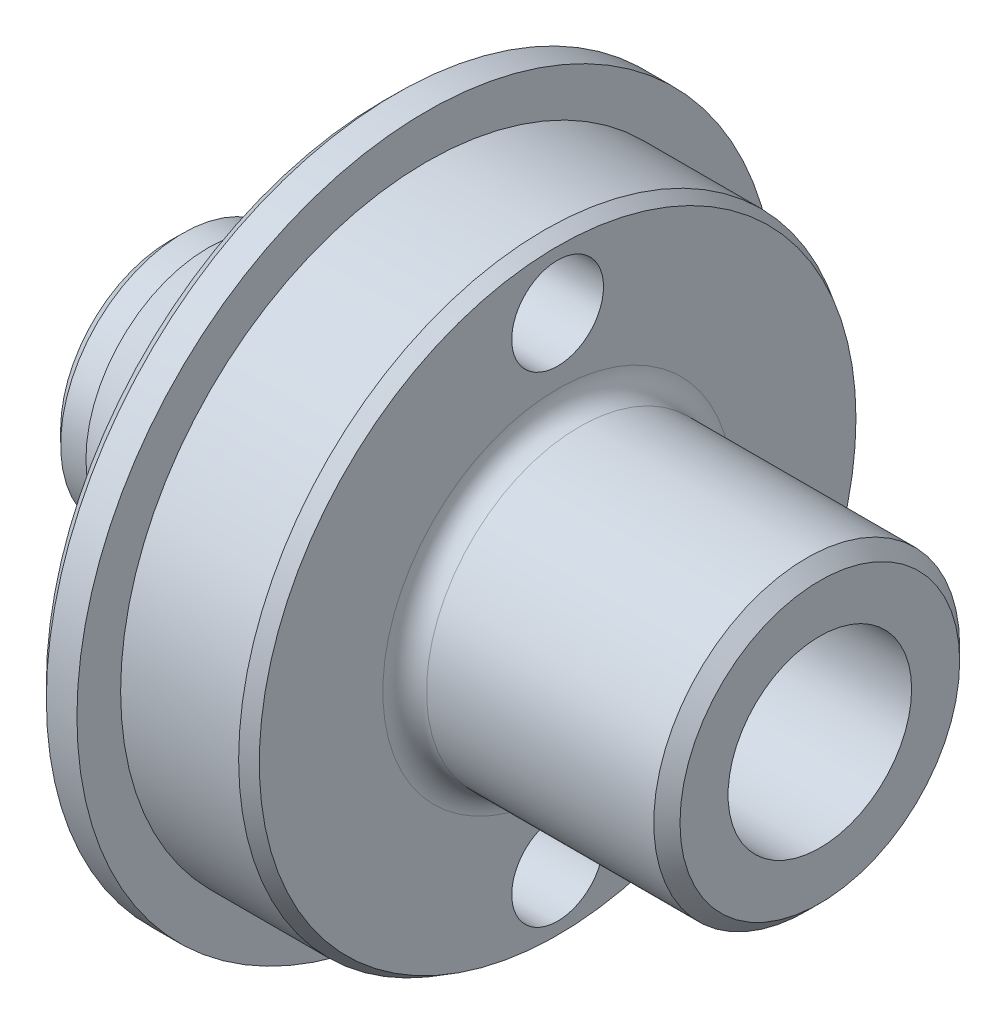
from build123d import *

# Parameters (mm, degrees)
ESQUISSE1_W           = 1
ESQUISSE1_H           = 8
ESQUISSE2_R           = 7
BOSS_EXTRU_1_DEPTH    = 3
ESQUISSE3_R           = 3.5
BOSS_EXTRU_2_DEPTH    = 6
ESQUISSE4_R           = 4.25
BOSS_EXTRU_3_DEPTH    = 4
BOSS_EXTRU_3_TAPER    = 20
ESQUISSE5_R           = 2.794119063
BOSS_EXTRU_4_DEPTH    = 0.878783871
PER_AGE1_D            = 2.1
PER_AGE2_D            = 2.1
TROU_TARAUD_M51_D     = 4.2
TROU_TARAUD_M51_DEPTH = 7.5
TROU_TARAUD_M51_TIP   = 1.2618073
CHANFREIN1_SIZE       = 0.3
CHANFREIN1_SIZE2      = 0.173205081
CONG_1_R              = 0.5
CHANFREIN3_SIZE       = 0.3
CHANFREIN4_SIZE       = 0.3


with BuildPart() as part:
    # Esquisse1 → R_volution1 (revolve)
    with BuildSketch(Plane.XY, mode=Mode.PRIVATE) as r_volution1_sk:
        with Locations((5.5, 4)):
            Rectangle(ESQUISSE1_W, ESQUISSE1_H)
    revolve(r_volution1_sk.sketch.rotate(Axis((5, 0, 0), (1, 0, 0)), 270), axis=Axis((5, 0, 0), (1, 0, 0)))

    # Esquisse2 → Boss.-Extru.1 (add)
    with BuildSketch(Plane(origin=(6, 0, 0), x_dir=(0, 0, -1), z_dir=(1, 0, 0))):
        Circle(ESQUISSE2_R)
    extrude(amount=BOSS_EXTRU_1_DEPTH)

    # Esquisse3 → Boss.-Extru.2 (add)
    with BuildSketch(Plane(origin=(9, 0, 0), x_dir=(0, 0, -1), z_dir=(1, 0, 0))):
        Circle(ESQUISSE3_R)
    extrude(amount=BOSS_EXTRU_2_DEPTH)

    # Esquisse4 → Boss.-Extru.3 (add)
    with BuildSketch(Plane.ZY.offset(-5)):
        Circle(ESQUISSE4_R)
    extrude(amount=BOSS_EXTRU_3_DEPTH, taper=BOSS_EXTRU_3_TAPER)

    # Esquisse5 → Boss.-Extru.4 (add)
    with BuildSketch(Plane.ZY.offset(-1)):
        with Locations(Location((0, 0, 0), (0, 0, 180))):
            Circle(ESQUISSE5_R)
    extrude(amount=BOSS_EXTRU_4_DEPTH)

    # Esquisse6 → Enl_vement de mati_re-R_volution1 (revolve, cut)
    with BuildSketch(Plane.XY, mode=Mode.PRIVATE) as enl_vement_de_mati_re_r_volution1_sk:
        Polygon((0, 1.5), (0, 0), (15, 0), (15, 0.75), (5.5, 0.75), (5.5, 1.5), align=None)
    revolve(enl_vement_de_mati_re_r_volution1_sk.sketch.rotate(Axis((0, 0, 0), (1, 0, 0)), 270), axis=Axis((0, 0, 0), (1, 0, 0)), mode=Mode.SUBTRACT)

    # Per_age1 (through all)
    with Locations(Plane(origin=(9, 0, 0), x_dir=(0, 0, -1), z_dir=(1, 0, 0))):
        with Locations((0, -5.5)):
            Hole(PER_AGE1_D / 2)

    # Per_age2 (through all)
    with Locations(Plane(origin=(9, 0, 0), x_dir=(0, 0, -1), z_dir=(1, 0, 0))):
        with Locations((0, 5.5)):
            Hole(PER_AGE2_D / 2)

    # Trou taraud_ M51
    with Locations(Plane(origin=(15, 0, 0), x_dir=(0, 0, -1), z_dir=(1, 0, 0))):
        with Locations((0, 0)):
            Hole(TROU_TARAUD_M51_D / 2, depth=TROU_TARAUD_M51_DEPTH)
            with Locations((0, 0, -(TROU_TARAUD_M51_DEPTH + TROU_TARAUD_M51_TIP / 2))):  # 118° drill point
                Cone(0, TROU_TARAUD_M51_D / 2, TROU_TARAUD_M51_TIP, mode=Mode.SUBTRACT)

    # Chanfrein1
    chanfrein1_edges = [part.edges().sort_by_distance(p)[0] for p in [
        (9, 0, 7),
    ]]
    chanfrein1_side = [part.faces().sort_by_distance(p)[0] for p in [
        (7.5, 0, 7),
    ]]
    chamfer(chanfrein1_edges, length=CHANFREIN1_SIZE, length2=CHANFREIN1_SIZE2, reference=chanfrein1_side[0])

    # Cong_1
    cong_1_edges = [part.edges().sort_by_distance(p)[0] for p in [
        (9, 0, 3.5),
    ]]
    fillet(cong_1_edges, radius=CONG_1_R)

    # Chanfrein3
    chanfrein3_edges = [part.edges().sort_by_distance(p)[0] for p in [
        (15, 0, 3.5),
    ]]
    chamfer(chanfrein3_edges, length=CHANFREIN3_SIZE)

    # Chanfrein4
    chanfrein4_edges = [part.edges().sort_by_distance(p)[0] for p in [
        (0.121216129, 0, 2.794119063),
        (5, 0, 8),
    ]]
    chamfer(chanfrein4_edges, length=CHANFREIN4_SIZE)


solid = part.part
